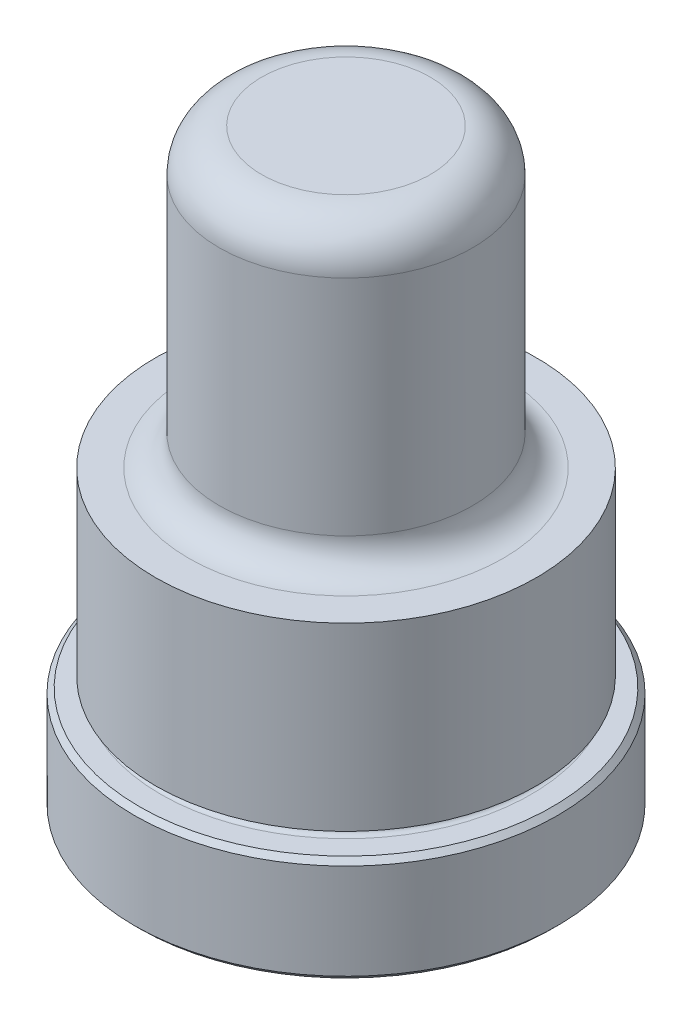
from build123d import *

# Parameters (mm, degrees)
CHAMFER1_SIZE = 0.381
FILLET1_R     = 3.175


with BuildPart() as part:
    # Sketch1 → Revolve1 (revolve)
    with BuildSketch(Plane(origin=(0, 0, 0), x_dir=(0, 0, -1), z_dir=(1, 0, 0)), mode=Mode.PRIVATE) as revolve1_sk:
        with BuildLine():
            Line((0, 0), (15.875, 0))
            Line((15.875, 0), (15.875, 7.9248))
            Line((15.875, 7.9248), (13.8938, 7.9248))
            ThreePointArc((13.8938, 7.9248), (13.5128, 8.3058), (13.8938, 8.6868))
            Line((13.8938, 8.6868), (14.3002, 8.6868))
            Line((14.3002, 8.6868), (14.3002, 22.225))
            Line((14.3002, 22.225), (11.7983, 22.225))
            ThreePointArc((11.7983, 22.225), (10.181853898, 22.894553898), (9.5123, 24.511))
            Line((9.5123, 24.511), (9.5123, 44.45))
            Line((9.5123, 44.45), (0, 44.45))
            Line((0, 44.45), (0, 0))
        make_face()
    revolve(revolve1_sk.sketch.rotate(Axis((0, 0, 0), (0, -1, 0)), 180), axis=Axis((0, 0, 0), (0, -1, 0)))

    # Chamfer1
    chamfer1_edges = [part.edges().sort_by_distance(p)[0] for p in [
        (0, 7.9248, -15.875),
        (0, 0, -15.875),
    ]]
    chamfer(chamfer1_edges, length=CHAMFER1_SIZE)

    # Fillet1
    fillet1_edges = [part.edges().sort_by_distance(p)[0] for p in [
        (0, 44.45, -9.5123),
    ]]
    fillet(fillet1_edges, radius=FILLET1_R)


solid = part.part
